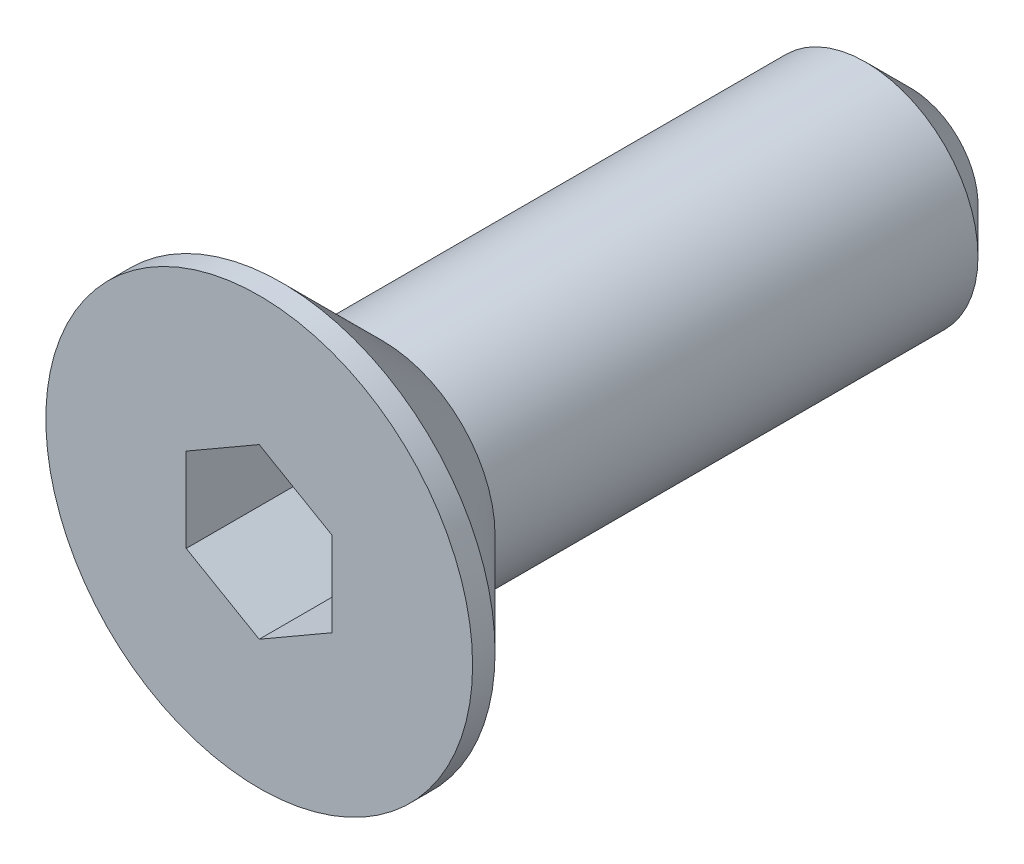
ISO-10303-21;
HEADER;
FILE_DESCRIPTION(('STEP AP214'),'2;1');
FILE_NAME('part.step','',(''),(''),'','','');
FILE_SCHEMA(('AUTOMOTIVE_DESIGN { 1 0 10303 214 1 1 1 1 }'));
ENDSEC;
DATA;
#1=APPLICATION_CONTEXT('core data for automotive mechanical design processes');
#2=APPLICATION_PROTOCOL_DEFINITION('international standard','automotive_design',2000,#1);
#3=PRODUCT_CONTEXT('',#1,'mechanical');
#4=PRODUCT('Part','Part','',(#3));
#5=PRODUCT_RELATED_PRODUCT_CATEGORY('part','',(#4));
#6=PRODUCT_DEFINITION_FORMATION('','',#4);
#7=PRODUCT_DEFINITION_CONTEXT('part definition',#1,'design');
#8=PRODUCT_DEFINITION('design','',#6,#7);
#9=PRODUCT_DEFINITION_SHAPE('','',#8);
#10=(LENGTH_UNIT() NAMED_UNIT(*) SI_UNIT(.MILLI.,.METRE.));
#11=(NAMED_UNIT(*) PLANE_ANGLE_UNIT() SI_UNIT($,.RADIAN.));
#12=(NAMED_UNIT(*) SI_UNIT($,.STERADIAN.) SOLID_ANGLE_UNIT());
#13=UNCERTAINTY_MEASURE_WITH_UNIT(LENGTH_MEASURE(1.E-05),#10,'distance_accuracy_value','');
#14=(GEOMETRIC_REPRESENTATION_CONTEXT(3) GLOBAL_UNCERTAINTY_ASSIGNED_CONTEXT((#13)) GLOBAL_UNIT_ASSIGNED_CONTEXT((#10,
#11,#12)) REPRESENTATION_CONTEXT('',''));
#15=CARTESIAN_POINT('',(0.,0.,0.));
#16=DIRECTION('',(0.,0.,1.));
#17=DIRECTION('',(1.,0.,0.));
#18=AXIS2_PLACEMENT_3D('',#15,#16,#17);
#19=CARTESIAN_POINT('',(0.,0.,0.));
#20=DIRECTION('',(0.,0.,1.));
#21=DIRECTION('',(1.,0.,0.));
#22=AXIS2_PLACEMENT_3D('',#19,#20,#21);
#23=PLANE('',#22);
#24=DIRECTION('',(-0.866025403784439,-0.5,0.));
#25=VECTOR('',#24,1.);
#26=CARTESIAN_POINT('',(0.,0.750555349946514,0.));
#27=LINE('',#26,#25);
#28=CARTESIAN_POINT('',(0.,0.750555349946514,0.));
#29=VERTEX_POINT('',#28);
#30=CARTESIAN_POINT('',(-0.65,0.375277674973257,0.));
#31=VERTEX_POINT('',#30);
#32=EDGE_CURVE('E92',#29,#31,#27,.T.);
#33=ORIENTED_EDGE('',*,*,#32,.F.);
#34=DIRECTION('',(-0.866025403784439,0.5,0.));
#35=VECTOR('',#34,1.);
#36=CARTESIAN_POINT('',(0.65,0.375277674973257,0.));
#37=LINE('',#36,#35);
#38=CARTESIAN_POINT('',(0.65,0.375277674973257,0.));
#39=VERTEX_POINT('',#38);
#40=EDGE_CURVE('E102',#39,#29,#37,.T.);
#41=ORIENTED_EDGE('',*,*,#40,.F.);
#42=DIRECTION('',(0.,1.,0.));
#43=VECTOR('',#42,1.);
#44=CARTESIAN_POINT('',(0.65,-0.375277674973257,0.));
#45=LINE('',#44,#43);
#46=CARTESIAN_POINT('',(0.65,-0.375277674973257,0.));
#47=VERTEX_POINT('',#46);
#48=EDGE_CURVE('E29',#47,#39,#45,.T.);
#49=ORIENTED_EDGE('',*,*,#48,.F.);
#50=DIRECTION('',(0.866025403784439,0.5,0.));
#51=VECTOR('',#50,1.);
#52=CARTESIAN_POINT('',(0.,-0.750555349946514,0.));
#53=LINE('',#52,#51);
#54=CARTESIAN_POINT('',(0.,-0.750555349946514,0.));
#55=VERTEX_POINT('',#54);
#56=EDGE_CURVE('E96',#55,#47,#53,.T.);
#57=ORIENTED_EDGE('',*,*,#56,.F.);
#58=DIRECTION('',(0.866025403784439,-0.5,0.));
#59=VECTOR('',#58,1.);
#60=CARTESIAN_POINT('',(-0.65,-0.375277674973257,0.));
#61=LINE('',#60,#59);
#62=CARTESIAN_POINT('',(-0.65,-0.375277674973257,0.));
#63=VERTEX_POINT('',#62);
#64=EDGE_CURVE('E81',#63,#55,#61,.T.);
#65=ORIENTED_EDGE('',*,*,#64,.F.);
#66=DIRECTION('',(0.,-1.,0.));
#67=VECTOR('',#66,1.);
#68=CARTESIAN_POINT('',(-0.65,0.375277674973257,0.));
#69=LINE('',#68,#67);
#70=EDGE_CURVE('E87',#31,#63,#69,.T.);
#71=ORIENTED_EDGE('',*,*,#70,.F.);
#72=EDGE_LOOP('',(#33,#41,#49,#57,#65,#71));
#73=FACE_BOUND('',#72,.T.);
#74=CARTESIAN_POINT('',(0.,0.,0.));
#75=DIRECTION('',(0.,0.,1.));
#76=DIRECTION('',(1.,0.,0.));
#77=AXIS2_PLACEMENT_3D('',#74,#75,#76);
#78=CIRCLE('',#77,1.9);
#79=CARTESIAN_POINT('',(1.9,0.,0.));
#80=VERTEX_POINT('',#79);
#81=EDGE_CURVE('E129',#80,#80,#78,.T.);
#82=ORIENTED_EDGE('',*,*,#81,.T.);
#83=EDGE_LOOP('',(#82));
#84=FACE_BOUND('',#83,.T.);
#85=ADVANCED_FACE('F14',(#73,#84),#23,.T.);
#86=CARTESIAN_POINT('',(0.,0.,6.05968084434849));
#87=DIRECTION('',(0.,0.,1.));
#88=DIRECTION('',(1.,0.,0.));
#89=AXIS2_PLACEMENT_3D('',#86,#87,#88);
#90=CYLINDRICAL_SURFACE('',#89,1.9);
#91=CARTESIAN_POINT('',(0.,0.,-0.2));
#92=DIRECTION('',(0.,0.,1.));
#93=DIRECTION('',(1.,0.,0.));
#94=AXIS2_PLACEMENT_3D('',#91,#92,#93);
#95=CIRCLE('',#94,1.9);
#96=CARTESIAN_POINT('',(1.9,0.,-0.2));
#97=VERTEX_POINT('',#96);
#98=EDGE_CURVE('E126',#97,#97,#95,.T.);
#99=ORIENTED_EDGE('',*,*,#98,.T.);
#100=EDGE_LOOP('',(#99));
#101=FACE_BOUND('',#100,.T.);
#102=ORIENTED_EDGE('',*,*,#81,.F.);
#103=EDGE_LOOP('',(#102));
#104=FACE_BOUND('',#103,.T.);
#105=ADVANCED_FACE('F152',(#101,#104),#90,.T.);
#106=CARTESIAN_POINT('',(0.,0.,-0.2));
#107=DIRECTION('',(0.,0.,1.));
#108=DIRECTION('',(1.,0.,0.));
#109=AXIS2_PLACEMENT_3D('',#106,#107,#108);
#110=CONICAL_SURFACE('',#109,1.9,0.78539816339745);
#111=CARTESIAN_POINT('',(0.,0.,-1.1));
#112=DIRECTION('',(0.,0.,1.));
#113=DIRECTION('',(1.,0.,0.));
#114=AXIS2_PLACEMENT_3D('',#111,#112,#113);
#115=CIRCLE('',#114,1.);
#116=CARTESIAN_POINT('',(1.,0.,-1.1));
#117=VERTEX_POINT('',#116);
#118=EDGE_CURVE('E123',#117,#117,#115,.T.);
#119=ORIENTED_EDGE('',*,*,#118,.T.);
#120=EDGE_LOOP('',(#119));
#121=FACE_BOUND('',#120,.T.);
#122=ORIENTED_EDGE('',*,*,#98,.F.);
#123=EDGE_LOOP('',(#122));
#124=FACE_BOUND('',#123,.T.);
#125=ADVANCED_FACE('F157',(#121,#124),#110,.T.);
#126=CARTESIAN_POINT('',(0.,0.,6.05968084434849));
#127=DIRECTION('',(0.,0.,1.));
#128=DIRECTION('',(1.,0.,0.));
#129=AXIS2_PLACEMENT_3D('',#126,#127,#128);
#130=CYLINDRICAL_SURFACE('',#129,1.);
#131=CARTESIAN_POINT('',(0.,0.,-5.4));
#132=DIRECTION('',(0.,0.,-1.));
#133=DIRECTION('',(-1.,0.,0.));
#134=AXIS2_PLACEMENT_3D('',#131,#132,#133);
#135=CIRCLE('',#134,1.);
#136=CARTESIAN_POINT('',(-1.,0.,-5.4));
#137=VERTEX_POINT('',#136);
#138=EDGE_CURVE('E22',#137,#137,#135,.F.);
#139=ORIENTED_EDGE('',*,*,#138,.T.);
#140=EDGE_LOOP('',(#139));
#141=FACE_BOUND('',#140,.T.);
#142=ORIENTED_EDGE('',*,*,#118,.F.);
#143=EDGE_LOOP('',(#142));
#144=FACE_BOUND('',#143,.T.);
#145=ADVANCED_FACE('F134',(#141,#144),#130,.T.);
#146=CARTESIAN_POINT('',(1.,0.,-5.8));
#147=DIRECTION('',(0.,0.,-1.));
#148=DIRECTION('',(-1.,0.,0.));
#149=AXIS2_PLACEMENT_3D('',#146,#147,#148);
#150=PLANE('',#149);
#151=CARTESIAN_POINT('',(0.,0.,-5.8));
#152=DIRECTION('',(0.,0.,-1.));
#153=DIRECTION('',(-1.,0.,0.));
#154=AXIS2_PLACEMENT_3D('',#151,#152,#153);
#155=CIRCLE('',#154,0.6);
#156=CARTESIAN_POINT('',(-0.6,0.,-5.8));
#157=VERTEX_POINT('',#156);
#158=EDGE_CURVE('E9',#157,#157,#155,.T.);
#159=ORIENTED_EDGE('',*,*,#158,.T.);
#160=EDGE_LOOP('',(#159));
#161=FACE_BOUND('',#160,.T.);
#162=ADVANCED_FACE('F139',(#161),#150,.T.);
#163=CARTESIAN_POINT('',(0.,0.,-5.4));
#164=DIRECTION('',(0.,0.,1.));
#165=DIRECTION('',(1.,0.,0.));
#166=AXIS2_PLACEMENT_3D('',#163,#164,#165);
#167=CONICAL_SURFACE('',#166,1.,0.785398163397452);
#168=ORIENTED_EDGE('',*,*,#158,.F.);
#169=EDGE_LOOP('',(#168));
#170=FACE_BOUND('',#169,.T.);
#171=ORIENTED_EDGE('',*,*,#138,.F.);
#172=EDGE_LOOP('',(#171));
#173=FACE_BOUND('',#172,.T.);
#174=ADVANCED_FACE('F16',(#170,#173),#167,.T.);
#175=CARTESIAN_POINT('',(0.,0.750555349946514,-2.98578280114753));
#176=DIRECTION('',(-0.5,0.866025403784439,0.));
#177=DIRECTION('',(-0.866025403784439,-0.5,0.));
#178=AXIS2_PLACEMENT_3D('',#175,#176,#177);
#179=PLANE('',#178);
#180=DIRECTION('',(0.,0.,1.));
#181=VECTOR('',#180,1.);
#182=CARTESIAN_POINT('',(0.,0.750555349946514,-2.98578280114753));
#183=LINE('',#182,#181);
#184=CARTESIAN_POINT('',(0.,0.750555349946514,-1.));
#185=VERTEX_POINT('',#184);
#186=EDGE_CURVE('E38',#185,#29,#183,.T.);
#187=ORIENTED_EDGE('',*,*,#186,.T.);
#188=ORIENTED_EDGE('',*,*,#32,.T.);
#189=DIRECTION('',(0.,0.,1.));
#190=VECTOR('',#189,1.);
#191=CARTESIAN_POINT('',(-0.65,0.375277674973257,-2.98578280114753));
#192=LINE('',#191,#190);
#193=CARTESIAN_POINT('',(-0.65,0.375277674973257,-1.));
#194=VERTEX_POINT('',#193);
#195=EDGE_CURVE('E89',#194,#31,#192,.T.);
#196=ORIENTED_EDGE('',*,*,#195,.F.);
#197=DIRECTION('',(-0.866025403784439,-0.5,0.));
#198=VECTOR('',#197,1.);
#199=CARTESIAN_POINT('',(0.,0.750555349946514,-1.));
#200=LINE('',#199,#198);
#201=EDGE_CURVE('E61',#185,#194,#200,.T.);
#202=ORIENTED_EDGE('',*,*,#201,.F.);
#203=EDGE_LOOP('',(#187,#188,#196,#202));
#204=FACE_BOUND('',#203,.T.);
#205=ADVANCED_FACE('F138',(#204),#179,.F.);
#206=CARTESIAN_POINT('',(-0.65,0.375277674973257,-2.98578280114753));
#207=DIRECTION('',(-1.,0.,0.));
#208=DIRECTION('',(0.,-1.,0.));
#209=AXIS2_PLACEMENT_3D('',#206,#207,#208);
#210=PLANE('',#209);
#211=ORIENTED_EDGE('',*,*,#195,.T.);
#212=ORIENTED_EDGE('',*,*,#70,.T.);
#213=DIRECTION('',(0.,0.,1.));
#214=VECTOR('',#213,1.);
#215=CARTESIAN_POINT('',(-0.65,-0.375277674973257,-2.98578280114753));
#216=LINE('',#215,#214);
#217=CARTESIAN_POINT('',(-0.65,-0.375277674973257,-1.));
#218=VERTEX_POINT('',#217);
#219=EDGE_CURVE('E76',#218,#63,#216,.T.);
#220=ORIENTED_EDGE('',*,*,#219,.F.);
#221=DIRECTION('',(0.,-1.,0.));
#222=VECTOR('',#221,1.);
#223=CARTESIAN_POINT('',(-0.65,0.375277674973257,-1.));
#224=LINE('',#223,#222);
#225=EDGE_CURVE('E70',#194,#218,#224,.T.);
#226=ORIENTED_EDGE('',*,*,#225,.F.);
#227=EDGE_LOOP('',(#211,#212,#220,#226));
#228=FACE_BOUND('',#227,.T.);
#229=ADVANCED_FACE('F88',(#228),#210,.F.);
#230=CARTESIAN_POINT('',(-0.65,-0.375277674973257,-2.98578280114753));
#231=DIRECTION('',(-0.5,-0.866025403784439,0.));
#232=DIRECTION('',(0.866025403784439,-0.5,0.));
#233=AXIS2_PLACEMENT_3D('',#230,#231,#232);
#234=PLANE('',#233);
#235=ORIENTED_EDGE('',*,*,#219,.T.);
#236=ORIENTED_EDGE('',*,*,#64,.T.);
#237=DIRECTION('',(0.,0.,1.));
#238=VECTOR('',#237,1.);
#239=CARTESIAN_POINT('',(0.,-0.750555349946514,-2.98578280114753));
#240=LINE('',#239,#238);
#241=CARTESIAN_POINT('',(0.,-0.750555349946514,-1.));
#242=VERTEX_POINT('',#241);
#243=EDGE_CURVE('E115',#242,#55,#240,.T.);
#244=ORIENTED_EDGE('',*,*,#243,.F.);
#245=DIRECTION('',(0.866025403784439,-0.5,0.));
#246=VECTOR('',#245,1.);
#247=CARTESIAN_POINT('',(-0.65,-0.375277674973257,-1.));
#248=LINE('',#247,#246);
#249=EDGE_CURVE('E84',#218,#242,#248,.T.);
#250=ORIENTED_EDGE('',*,*,#249,.F.);
#251=EDGE_LOOP('',(#235,#236,#244,#250));
#252=FACE_BOUND('',#251,.T.);
#253=ADVANCED_FACE('F78',(#252),#234,.F.);
#254=CARTESIAN_POINT('',(0.,-0.750555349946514,-2.98578280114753));
#255=DIRECTION('',(0.5,-0.866025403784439,0.));
#256=DIRECTION('',(0.866025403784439,0.5,0.));
#257=AXIS2_PLACEMENT_3D('',#254,#255,#256);
#258=PLANE('',#257);
#259=ORIENTED_EDGE('',*,*,#243,.T.);
#260=ORIENTED_EDGE('',*,*,#56,.T.);
#261=DIRECTION('',(0.,0.,1.));
#262=VECTOR('',#261,1.);
#263=CARTESIAN_POINT('',(0.65,-0.375277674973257,-2.98578280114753));
#264=LINE('',#263,#262);
#265=CARTESIAN_POINT('',(0.65,-0.375277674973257,-1.));
#266=VERTEX_POINT('',#265);
#267=EDGE_CURVE('E111',#266,#47,#264,.T.);
#268=ORIENTED_EDGE('',*,*,#267,.F.);
#269=DIRECTION('',(0.866025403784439,0.5,0.));
#270=VECTOR('',#269,1.);
#271=CARTESIAN_POINT('',(0.,-0.750555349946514,-1.));
#272=LINE('',#271,#270);
#273=EDGE_CURVE('E112',#242,#266,#272,.T.);
#274=ORIENTED_EDGE('',*,*,#273,.F.);
#275=EDGE_LOOP('',(#259,#260,#268,#274));
#276=FACE_BOUND('',#275,.T.);
#277=ADVANCED_FACE('F175',(#276),#258,.F.);
#278=CARTESIAN_POINT('',(0.65,-0.375277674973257,-2.98578280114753));
#279=DIRECTION('',(1.,0.,0.));
#280=DIRECTION('',(0.,0.,-1.));
#281=AXIS2_PLACEMENT_3D('',#278,#279,#280);
#282=PLANE('',#281);
#283=ORIENTED_EDGE('',*,*,#267,.T.);
#284=ORIENTED_EDGE('',*,*,#48,.T.);
#285=DIRECTION('',(0.,0.,1.));
#286=VECTOR('',#285,1.);
#287=CARTESIAN_POINT('',(0.65,0.375277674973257,-2.98578280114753));
#288=LINE('',#287,#286);
#289=CARTESIAN_POINT('',(0.65,0.375277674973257,-1.));
#290=VERTEX_POINT('',#289);
#291=EDGE_CURVE('E107',#290,#39,#288,.T.);
#292=ORIENTED_EDGE('',*,*,#291,.F.);
#293=DIRECTION('',(0.,1.,0.));
#294=VECTOR('',#293,1.);
#295=CARTESIAN_POINT('',(0.65,-0.375277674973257,-1.));
#296=LINE('',#295,#294);
#297=EDGE_CURVE('E108',#266,#290,#296,.T.);
#298=ORIENTED_EDGE('',*,*,#297,.F.);
#299=EDGE_LOOP('',(#283,#284,#292,#298));
#300=FACE_BOUND('',#299,.T.);
#301=ADVANCED_FACE('F178',(#300),#282,.F.);
#302=CARTESIAN_POINT('',(0.65,0.375277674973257,-2.98578280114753));
#303=DIRECTION('',(0.5,0.866025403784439,0.));
#304=DIRECTION('',(-0.866025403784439,0.5,0.));
#305=AXIS2_PLACEMENT_3D('',#302,#303,#304);
#306=PLANE('',#305);
#307=ORIENTED_EDGE('',*,*,#291,.T.);
#308=ORIENTED_EDGE('',*,*,#40,.T.);
#309=ORIENTED_EDGE('',*,*,#186,.F.);
#310=DIRECTION('',(-0.866025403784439,0.5,0.));
#311=VECTOR('',#310,1.);
#312=CARTESIAN_POINT('',(0.65,0.375277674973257,-1.));
#313=LINE('',#312,#311);
#314=EDGE_CURVE('E105',#290,#185,#313,.T.);
#315=ORIENTED_EDGE('',*,*,#314,.F.);
#316=EDGE_LOOP('',(#307,#308,#309,#315));
#317=FACE_BOUND('',#316,.T.);
#318=ADVANCED_FACE('F168',(#317),#306,.F.);
#319=CARTESIAN_POINT('',(-1.,0.,-1.));
#320=DIRECTION('',(0.,0.,-1.));
#321=DIRECTION('',(-1.,0.,0.));
#322=AXIS2_PLACEMENT_3D('',#319,#320,#321);
#323=PLANE('',#322);
#324=ORIENTED_EDGE('',*,*,#314,.T.);
#325=ORIENTED_EDGE('',*,*,#201,.T.);
#326=ORIENTED_EDGE('',*,*,#225,.T.);
#327=ORIENTED_EDGE('',*,*,#249,.T.);
#328=ORIENTED_EDGE('',*,*,#273,.T.);
#329=ORIENTED_EDGE('',*,*,#297,.T.);
#330=EDGE_LOOP('',(#324,#325,#326,#327,#328,#329));
#331=FACE_BOUND('',#330,.T.);
#332=ADVANCED_FACE('F166',(#331),#323,.F.);
#333=CLOSED_SHELL('',(#85,#105,#125,#145,#162,#174,#205,#229,#253,#277,#301,#318,#332));
#334=MANIFOLD_SOLID_BREP('B1',#333);
#335=ADVANCED_BREP_SHAPE_REPRESENTATION('',(#18,#334),#14);
#336=SHAPE_DEFINITION_REPRESENTATION(#9,#335);
ENDSEC;
END-ISO-10303-21;
